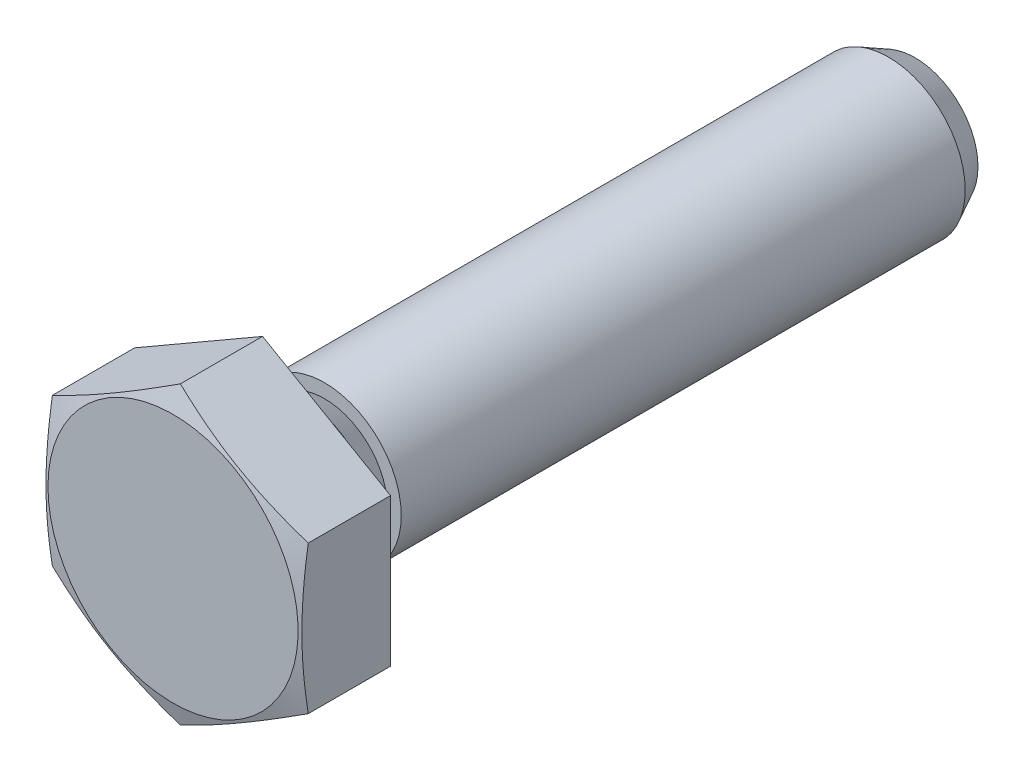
ISO-10303-21;
HEADER;
FILE_DESCRIPTION(('STEP AP214'),'2;1');
FILE_NAME('part.step','',(''),(''),'','','');
FILE_SCHEMA(('AUTOMOTIVE_DESIGN { 1 0 10303 214 1 1 1 1 }'));
ENDSEC;
DATA;
#1=APPLICATION_CONTEXT('core data for automotive mechanical design processes');
#2=APPLICATION_PROTOCOL_DEFINITION('international standard','automotive_design',2000,#1);
#3=PRODUCT_CONTEXT('',#1,'mechanical');
#4=PRODUCT('Part','Part','',(#3));
#5=PRODUCT_RELATED_PRODUCT_CATEGORY('part','',(#4));
#6=PRODUCT_DEFINITION_FORMATION('','',#4);
#7=PRODUCT_DEFINITION_CONTEXT('part definition',#1,'design');
#8=PRODUCT_DEFINITION('design','',#6,#7);
#9=PRODUCT_DEFINITION_SHAPE('','',#8);
#10=(LENGTH_UNIT() NAMED_UNIT(*) SI_UNIT(.MILLI.,.METRE.));
#11=(NAMED_UNIT(*) PLANE_ANGLE_UNIT() SI_UNIT($,.RADIAN.));
#12=(NAMED_UNIT(*) SI_UNIT($,.STERADIAN.) SOLID_ANGLE_UNIT());
#13=UNCERTAINTY_MEASURE_WITH_UNIT(LENGTH_MEASURE(1.E-05),#10,'distance_accuracy_value','');
#14=(GEOMETRIC_REPRESENTATION_CONTEXT(3) GLOBAL_UNCERTAINTY_ASSIGNED_CONTEXT((#13)) GLOBAL_UNIT_ASSIGNED_CONTEXT((#10,
#11,#12)) REPRESENTATION_CONTEXT('',''));
#15=CARTESIAN_POINT('',(0.,0.,0.));
#16=DIRECTION('',(0.,0.,1.));
#17=DIRECTION('',(1.,0.,0.));
#18=AXIS2_PLACEMENT_3D('',#15,#16,#17);
#19=CARTESIAN_POINT('',(0.,0.,0.5));
#20=DIRECTION('',(0.,0.,1.));
#21=DIRECTION('',(1.,0.,0.));
#22=AXIS2_PLACEMENT_3D('',#19,#20,#21);
#23=TOROIDAL_SURFACE('',#22,3.85,0.5);
#24=CARTESIAN_POINT('',(0.,0.,0.5));
#25=DIRECTION('',(0.,0.,1.));
#26=DIRECTION('',(1.,0.,0.));
#27=AXIS2_PLACEMENT_3D('',#24,#25,#26);
#28=CIRCLE('',#27,4.35);
#29=CARTESIAN_POINT('',(4.35,0.,0.5));
#30=VERTEX_POINT('',#29);
#31=EDGE_CURVE('E11',#30,#30,#28,.T.);
#32=ORIENTED_EDGE('',*,*,#31,.F.);
#33=EDGE_LOOP('',(#32));
#34=FACE_BOUND('',#33,.T.);
#35=CARTESIAN_POINT('',(0.,0.,0.));
#36=DIRECTION('',(0.,0.,1.));
#37=DIRECTION('',(1.,0.,0.));
#38=AXIS2_PLACEMENT_3D('',#35,#36,#37);
#39=CIRCLE('',#38,3.85);
#40=CARTESIAN_POINT('',(3.85,0.,0.));
#41=VERTEX_POINT('',#40);
#42=EDGE_CURVE('E23',#41,#41,#39,.T.);
#43=ORIENTED_EDGE('',*,*,#42,.T.);
#44=EDGE_LOOP('',(#43));
#45=FACE_BOUND('',#44,.T.);
#46=ADVANCED_FACE('F16',(#34,#45),#23,.T.);
#47=CARTESIAN_POINT('',(0.,3.85,0.));
#48=DIRECTION('',(0.,0.,-1.));
#49=DIRECTION('',(-1.,0.,0.));
#50=AXIS2_PLACEMENT_3D('',#47,#48,#49);
#51=PLANE('',#50);
#52=CARTESIAN_POINT('',(0.,0.,0.));
#53=DIRECTION('',(0.,0.,1.));
#54=DIRECTION('',(1.,0.,0.));
#55=AXIS2_PLACEMENT_3D('',#52,#53,#54);
#56=CIRCLE('',#55,3.3);
#57=CARTESIAN_POINT('',(3.3,0.,0.));
#58=VERTEX_POINT('',#57);
#59=EDGE_CURVE('E117',#58,#58,#56,.T.);
#60=ORIENTED_EDGE('',*,*,#59,.T.);
#61=EDGE_LOOP('',(#60));
#62=FACE_BOUND('',#61,.T.);
#63=ORIENTED_EDGE('',*,*,#42,.F.);
#64=EDGE_LOOP('',(#63));
#65=FACE_BOUND('',#64,.T.);
#66=ADVANCED_FACE('F123',(#62,#65),#51,.T.);
#67=CARTESIAN_POINT('',(0.,0.,-0.3));
#68=DIRECTION('',(0.,0.,1.));
#69=DIRECTION('',(1.,0.,0.));
#70=AXIS2_PLACEMENT_3D('',#67,#68,#69);
#71=TOROIDAL_SURFACE('',#70,3.3,0.3);
#72=CARTESIAN_POINT('',(0.,0.,-0.3));
#73=DIRECTION('',(0.,0.,1.));
#74=DIRECTION('',(1.,0.,0.));
#75=AXIS2_PLACEMENT_3D('',#72,#73,#74);
#76=CIRCLE('',#75,3.);
#77=CARTESIAN_POINT('',(3.,0.,-0.3));
#78=VERTEX_POINT('',#77);
#79=EDGE_CURVE('E114',#78,#78,#76,.T.);
#80=ORIENTED_EDGE('',*,*,#79,.T.);
#81=EDGE_LOOP('',(#80));
#82=FACE_BOUND('',#81,.T.);
#83=ORIENTED_EDGE('',*,*,#59,.F.);
#84=EDGE_LOOP('',(#83));
#85=FACE_BOUND('',#84,.T.);
#86=ADVANCED_FACE('F125',(#82,#85),#71,.F.);
#87=CARTESIAN_POINT('',(0.,0.,0.5));
#88=DIRECTION('',(0.,0.,1.));
#89=DIRECTION('',(1.,0.,0.));
#90=AXIS2_PLACEMENT_3D('',#87,#88,#89);
#91=CYLINDRICAL_SURFACE('',#90,3.);
#92=CARTESIAN_POINT('',(0.,0.,-0.982527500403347));
#93=DIRECTION('',(0.,0.,1.));
#94=DIRECTION('',(1.,0.,0.));
#95=AXIS2_PLACEMENT_3D('',#92,#93,#94);
#96=CIRCLE('',#95,3.);
#97=CARTESIAN_POINT('',(3.,0.,-0.982527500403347));
#98=VERTEX_POINT('',#97);
#99=EDGE_CURVE('E111',#98,#98,#96,.T.);
#100=ORIENTED_EDGE('',*,*,#99,.T.);
#101=EDGE_LOOP('',(#100));
#102=FACE_BOUND('',#101,.T.);
#103=ORIENTED_EDGE('',*,*,#79,.F.);
#104=EDGE_LOOP('',(#103));
#105=FACE_BOUND('',#104,.T.);
#106=ADVANCED_FACE('F132',(#102,#105),#91,.T.);
#107=CARTESIAN_POINT('',(0.,0.,-0.982527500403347));
#108=DIRECTION('',(0.,0.,1.));
#109=DIRECTION('',(1.,0.,0.));
#110=AXIS2_PLACEMENT_3D('',#107,#108,#109);
#111=CONICAL_SURFACE('',#110,3.,0.523598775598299);
#112=CARTESIAN_POINT('',(0.,0.,-1.92));
#113=DIRECTION('',(0.,0.,1.));
#114=DIRECTION('',(1.,0.,0.));
#115=AXIS2_PLACEMENT_3D('',#112,#113,#114);
#116=CIRCLE('',#115,2.45875);
#117=CARTESIAN_POINT('',(2.45875,0.,-1.92));
#118=VERTEX_POINT('',#117);
#119=EDGE_CURVE('E108',#118,#118,#116,.T.);
#120=ORIENTED_EDGE('',*,*,#119,.T.);
#121=EDGE_LOOP('',(#120));
#122=FACE_BOUND('',#121,.T.);
#123=ORIENTED_EDGE('',*,*,#99,.F.);
#124=EDGE_LOOP('',(#123));
#125=FACE_BOUND('',#124,.T.);
#126=ADVANCED_FACE('F139',(#122,#125),#111,.T.);
#127=CARTESIAN_POINT('',(0.,2.45875,-1.92));
#128=DIRECTION('',(0.,0.,1.));
#129=DIRECTION('',(1.,0.,0.));
#130=AXIS2_PLACEMENT_3D('',#127,#128,#129);
#131=PLANE('',#130);
#132=CARTESIAN_POINT('',(0.,0.,-1.92));
#133=DIRECTION('',(0.,0.,1.));
#134=DIRECTION('',(1.,0.,0.));
#135=AXIS2_PLACEMENT_3D('',#132,#133,#134);
#136=CIRCLE('',#135,3.);
#137=CARTESIAN_POINT('',(3.,0.,-1.92));
#138=VERTEX_POINT('',#137);
#139=EDGE_CURVE('E105',#138,#138,#136,.T.);
#140=ORIENTED_EDGE('',*,*,#139,.T.);
#141=EDGE_LOOP('',(#140));
#142=FACE_BOUND('',#141,.T.);
#143=ORIENTED_EDGE('',*,*,#119,.F.);
#144=EDGE_LOOP('',(#143));
#145=FACE_BOUND('',#144,.T.);
#146=ADVANCED_FACE('F143',(#142,#145),#131,.T.);
#147=CARTESIAN_POINT('',(0.,0.,0.5));
#148=DIRECTION('',(0.,0.,1.));
#149=DIRECTION('',(1.,0.,0.));
#150=AXIS2_PLACEMENT_3D('',#147,#148,#149);
#151=CYLINDRICAL_SURFACE('',#150,3.);
#152=CARTESIAN_POINT('',(0.,0.,-23.95875));
#153=DIRECTION('',(0.,0.,1.));
#154=DIRECTION('',(1.,0.,0.));
#155=AXIS2_PLACEMENT_3D('',#152,#153,#154);
#156=CIRCLE('',#155,3.);
#157=CARTESIAN_POINT('',(3.,0.,-23.95875));
#158=VERTEX_POINT('',#157);
#159=EDGE_CURVE('E102',#158,#158,#156,.T.);
#160=ORIENTED_EDGE('',*,*,#159,.T.);
#161=EDGE_LOOP('',(#160));
#162=FACE_BOUND('',#161,.T.);
#163=ORIENTED_EDGE('',*,*,#139,.F.);
#164=EDGE_LOOP('',(#163));
#165=FACE_BOUND('',#164,.T.);
#166=ADVANCED_FACE('F147',(#162,#165),#151,.T.);
#167=CARTESIAN_POINT('',(0.,0.,-23.95875));
#168=DIRECTION('',(0.,0.,1.));
#169=DIRECTION('',(1.,0.,0.));
#170=AXIS2_PLACEMENT_3D('',#167,#168,#169);
#171=CONICAL_SURFACE('',#170,3.,0.479368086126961);
#172=CARTESIAN_POINT('',(0.,0.,-25.));
#173=DIRECTION('',(0.,0.,1.));
#174=DIRECTION('',(1.,0.,0.));
#175=AXIS2_PLACEMENT_3D('',#172,#173,#174);
#176=CIRCLE('',#175,2.45875);
#177=CARTESIAN_POINT('',(2.45875,0.,-25.));
#178=VERTEX_POINT('',#177);
#179=EDGE_CURVE('E99',#178,#178,#176,.T.);
#180=ORIENTED_EDGE('',*,*,#179,.T.);
#181=EDGE_LOOP('',(#180));
#182=FACE_BOUND('',#181,.T.);
#183=ORIENTED_EDGE('',*,*,#159,.F.);
#184=EDGE_LOOP('',(#183));
#185=FACE_BOUND('',#184,.T.);
#186=ADVANCED_FACE('F151',(#182,#185),#171,.T.);
#187=CARTESIAN_POINT('',(0.,2.45875,-25.));
#188=DIRECTION('',(0.,0.,-1.));
#189=DIRECTION('',(-1.,0.,0.));
#190=AXIS2_PLACEMENT_3D('',#187,#188,#189);
#191=PLANE('',#190);
#192=ORIENTED_EDGE('',*,*,#179,.F.);
#193=EDGE_LOOP('',(#192));
#194=FACE_BOUND('',#193,.T.);
#195=ADVANCED_FACE('F155',(#194),#191,.T.);
#196=CARTESIAN_POINT('',(-5.,-2.8875,0.5));
#197=DIRECTION('',(0.,0.,-1.));
#198=DIRECTION('',(-1.,0.,0.));
#199=AXIS2_PLACEMENT_3D('',#196,#197,#198);
#200=PLANE('',#199);
#201=DIRECTION('',(0.,-1.,0.));
#202=VECTOR('',#201,1.);
#203=CARTESIAN_POINT('',(-5.,2.8875,0.5));
#204=LINE('',#203,#202);
#205=CARTESIAN_POINT('',(-5.,2.8875,0.5));
#206=VERTEX_POINT('',#205);
#207=CARTESIAN_POINT('',(-5.,-2.8875,0.5));
#208=VERTEX_POINT('',#207);
#209=EDGE_CURVE('E82',#206,#208,#204,.T.);
#210=ORIENTED_EDGE('',*,*,#209,.F.);
#211=DIRECTION('',(0.865969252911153,0.500097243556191,0.));
#212=VECTOR('',#211,1.);
#213=CARTESIAN_POINT('',(-5.,2.8875,0.5));
#214=LINE('',#213,#212);
#215=CARTESIAN_POINT('',(0.,5.775,0.5));
#216=VERTEX_POINT('',#215);
#217=EDGE_CURVE('E87',#206,#216,#214,.T.);
#218=ORIENTED_EDGE('',*,*,#217,.T.);
#219=DIRECTION('',(0.865969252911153,-0.500097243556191,0.));
#220=VECTOR('',#219,1.);
#221=CARTESIAN_POINT('',(0.,5.775,0.5));
#222=LINE('',#221,#220);
#223=CARTESIAN_POINT('',(5.,2.8875,0.5));
#224=VERTEX_POINT('',#223);
#225=EDGE_CURVE('E93',#216,#224,#222,.T.);
#226=ORIENTED_EDGE('',*,*,#225,.T.);
#227=DIRECTION('',(0.,-1.,0.));
#228=VECTOR('',#227,1.);
#229=CARTESIAN_POINT('',(5.,2.8875,0.5));
#230=LINE('',#229,#228);
#231=CARTESIAN_POINT('',(5.,-2.8875,0.5));
#232=VERTEX_POINT('',#231);
#233=EDGE_CURVE('E245',#224,#232,#230,.T.);
#234=ORIENTED_EDGE('',*,*,#233,.T.);
#235=DIRECTION('',(-0.865969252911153,-0.500097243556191,0.));
#236=VECTOR('',#235,1.);
#237=CARTESIAN_POINT('',(5.,-2.8875,0.5));
#238=LINE('',#237,#236);
#239=CARTESIAN_POINT('',(0.,-5.775,0.5));
#240=VERTEX_POINT('',#239);
#241=EDGE_CURVE('E231',#232,#240,#238,.T.);
#242=ORIENTED_EDGE('',*,*,#241,.T.);
#243=DIRECTION('',(-0.865969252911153,0.500097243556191,0.));
#244=VECTOR('',#243,1.);
#245=CARTESIAN_POINT('',(0.,-5.775,0.5));
#246=LINE('',#245,#244);
#247=EDGE_CURVE('E229',#240,#208,#246,.T.);
#248=ORIENTED_EDGE('',*,*,#247,.T.);
#249=EDGE_LOOP('',(#210,#218,#226,#234,#242,#248));
#250=FACE_BOUND('',#249,.T.);
#251=ORIENTED_EDGE('',*,*,#31,.T.);
#252=EDGE_LOOP('',(#251));
#253=FACE_BOUND('',#252,.T.);
#254=ADVANCED_FACE('F159',(#250,#253),#200,.T.);
#255=CARTESIAN_POINT('',(-5.,2.8875,0.5));
#256=DIRECTION('',(-1.,0.,0.));
#257=DIRECTION('',(0.,0.,1.));
#258=AXIS2_PLACEMENT_3D('',#255,#256,#257);
#259=PLANE('',#258);
#260=CARTESIAN_POINT('',(-5.,-7.63946219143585,2.6270341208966));
#261=CARTESIAN_POINT('',(-5.,-7.41281266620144,2.68839123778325));
#262=CARTESIAN_POINT('',(-5.,-7.18596133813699,2.74901642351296));
#263=CARTESIAN_POINT('',(-5.,-6.73175411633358,2.86840192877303));
#264=CARTESIAN_POINT('',(-5.,-6.50439819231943,2.92716213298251));
#265=CARTESIAN_POINT('',(-5.,-6.04878200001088,3.04249171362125));
#266=CARTESIAN_POINT('',(-5.,-5.82052090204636,3.09905782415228));
#267=CARTESIAN_POINT('',(-5.,-5.36331657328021,3.20936096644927));
#268=CARTESIAN_POINT('',(-5.,-5.13437335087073,3.26309803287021));
#269=CARTESIAN_POINT('',(-5.,-4.67835713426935,3.36644809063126));
#270=CARTESIAN_POINT('',(-5.,-4.45129342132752,3.41610183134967));
#271=CARTESIAN_POINT('',(-5.,-3.99627399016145,3.51113059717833));
#272=CARTESIAN_POINT('',(-5.,-3.76831830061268,3.55650575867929));
#273=CARTESIAN_POINT('',(-5.,-3.31144655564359,3.64194061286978));
#274=CARTESIAN_POINT('',(-5.,-3.0825306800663,3.68200125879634));
#275=CARTESIAN_POINT('',(-5.,-2.62364102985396,3.75560301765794));
#276=CARTESIAN_POINT('',(-5.,-2.39366725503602,3.78914412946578));
#277=CARTESIAN_POINT('',(-5.,-1.93195203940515,3.84847369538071));
#278=CARTESIAN_POINT('',(-5.,-1.70020728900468,3.87423677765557));
#279=CARTESIAN_POINT('',(-5.,-1.23587231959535,3.91656765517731));
#280=CARTESIAN_POINT('',(-5.,-1.00328213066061,3.93313577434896));
#281=CARTESIAN_POINT('',(-5.,-0.537748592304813,3.95607720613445));
#282=CARTESIAN_POINT('',(-5.,-0.304805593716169,3.96245749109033));
#283=CARTESIAN_POINT('',(-5.,0.161130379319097,3.96462349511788));
#284=CARTESIAN_POINT('',(-5.,0.394123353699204,3.9604092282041));
#285=CARTESIAN_POINT('',(-5.,0.860893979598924,3.94161836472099));
#286=CARTESIAN_POINT('',(-5.,1.09466942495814,3.92698808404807));
#287=CARTESIAN_POINT('',(-5.,1.56142284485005,3.88821444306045));
#288=CARTESIAN_POINT('',(-5.,1.79440079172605,3.86407075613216));
#289=CARTESIAN_POINT('',(-5.,2.25956828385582,3.80751771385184));
#290=CARTESIAN_POINT('',(-5.,2.49175682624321,3.77510023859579));
#291=CARTESIAN_POINT('',(-5.,2.95505625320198,3.70338237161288));
#292=CARTESIAN_POINT('',(-5.,3.18616713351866,3.66408195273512));
#293=CARTESIAN_POINT('',(-5.,3.63306122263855,3.58248240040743));
#294=CARTESIAN_POINT('',(-5.,3.84890657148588,3.54052013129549));
#295=CARTESIAN_POINT('',(-5.,4.27977835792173,3.45256422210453));
#296=CARTESIAN_POINT('',(-5.,4.49480476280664,3.40657042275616));
#297=CARTESIAN_POINT('',(-5.,4.92415472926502,3.31130044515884));
#298=CARTESIAN_POINT('',(-5.,5.1384781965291,3.26202384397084));
#299=CARTESIAN_POINT('',(-5.,5.56649441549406,3.16079723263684));
#300=CARTESIAN_POINT('',(-5.,5.78018715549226,3.10884717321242));
#301=CARTESIAN_POINT('',(-5.,6.42057759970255,2.94971540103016));
#302=CARTESIAN_POINT('',(-5.,6.84646584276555,2.8392797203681));
#303=CARTESIAN_POINT('',(-5.,7.69662619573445,2.61255430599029));
#304=CARTESIAN_POINT('',(-5.,8.12089843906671,2.49626506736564));
#305=CARTESIAN_POINT('',(-5.,8.96241707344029,2.26120860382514));
#306=CARTESIAN_POINT('',(-5.,9.37967934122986,2.14249806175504));
#307=CARTESIAN_POINT('',(-5.,10.2133768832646,1.90217595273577));
#308=CARTESIAN_POINT('',(-5.,10.6298121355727,1.7805643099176));
#309=CARTESIAN_POINT('',(-5.,11.4613370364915,1.53540730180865));
#310=CARTESIAN_POINT('',(-5.,11.876427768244,1.41186560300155));
#311=CARTESIAN_POINT('',(-5.,12.70609470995,1.16313510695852));
#312=CARTESIAN_POINT('',(-5.,13.120670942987,1.03794638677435));
#313=CARTESIAN_POINT('',(-5.,13.5350675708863,0.912173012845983));
#314=B_SPLINE_CURVE_WITH_KNOTS('',3,(#260,#261,#262,#263,#264,#265,#266,#267,#268,#269,#270,
#271,#272,#273,#274,#275,#276,#277,#278,#279,#280,#281,#282,#283,#284,#285,#286,#287,#288,#289,
#290,#291,#292,#293,#294,#295,#296,#297,#298,#299,#300,#301,#302,#303,#304,#305,#306,#307,#308,
#309,#310,#311,#312,#313),.UNSPECIFIED.,.F.,.F.,(4,2,2,2,2,2,2,2,2,2,2,2,2,2,2,2,2,2,2,2,2,2,2,
2,2,2,4),(0.,0.704427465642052,1.40889840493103,2.11438057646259,2.81985410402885,
3.51710954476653,4.21434275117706,4.91145072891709,5.60855882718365,6.30791690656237,
7.00725034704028,7.70610497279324,8.40495867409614,9.10744058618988,9.80994661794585,
10.5131447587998,11.2163456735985,11.87595945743,12.5355993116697,13.1953243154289,
13.8550614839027,15.1749100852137,16.4946472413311,17.7960931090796,19.0975730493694,
20.3968251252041,21.6960166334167),.UNSPECIFIED.);
#315=CARTESIAN_POINT('',(-5.,2.8875,3.71325728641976));
#316=VERTEX_POINT('',#315);
#317=CARTESIAN_POINT('',(-5.,-2.8875,3.71325728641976));
#318=VERTEX_POINT('',#317);
#319=EDGE_CURVE('E71',#316,#318,#314,.F.);
#320=ORIENTED_EDGE('',*,*,#319,.F.);
#321=DIRECTION('',(0.,0.,1.));
#322=VECTOR('',#321,1.);
#323=CARTESIAN_POINT('',(-5.,2.8875,0.5));
#324=LINE('',#323,#322);
#325=EDGE_CURVE('E80',#206,#316,#324,.T.);
#326=ORIENTED_EDGE('',*,*,#325,.F.);
#327=ORIENTED_EDGE('',*,*,#209,.T.);
#328=DIRECTION('',(0.,0.,1.));
#329=VECTOR('',#328,1.);
#330=CARTESIAN_POINT('',(-5.,-2.8875,0.5));
#331=LINE('',#330,#329);
#332=EDGE_CURVE('E38',#208,#318,#331,.T.);
#333=ORIENTED_EDGE('',*,*,#332,.T.);
#334=EDGE_LOOP('',(#320,#326,#327,#333));
#335=FACE_BOUND('',#334,.T.);
#336=ADVANCED_FACE('F78',(#335),#259,.T.);
#337=CARTESIAN_POINT('',(0.,-5.775,0.5));
#338=DIRECTION('',(0.500097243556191,0.865969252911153,0.));
#339=DIRECTION('',(0.865969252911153,-0.500097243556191,0.));
#340=AXIS2_PLACEMENT_3D('',#337,#338,#339);
#341=PLANE('',#340);
#342=DIRECTION('',(0.,0.,1.));
#343=VECTOR('',#342,1.);
#344=CARTESIAN_POINT('',(0.,-5.775,0.5));
#345=LINE('',#344,#343);
#346=CARTESIAN_POINT('',(0.,-5.775,3.71289386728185));
#347=VERTEX_POINT('',#346);
#348=EDGE_CURVE('E236',#240,#347,#345,.T.);
#349=ORIENTED_EDGE('',*,*,#348,.T.);
#350=CARTESIAN_POINT('',(2.00000000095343E-07,-5.7750001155,3.71289382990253));
#351=CARTESIAN_POINT('',(-0.207321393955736,-5.65527189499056,3.75165513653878));
#352=CARTESIAN_POINT('',(-0.415186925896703,-5.53522955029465,3.7868847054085));
#353=CARTESIAN_POINT('',(-0.831987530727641,-5.29452720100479,3.84883123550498));
#354=CARTESIAN_POINT('',(-1.0409231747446,-5.17386686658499,3.87554303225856));
#355=CARTESIAN_POINT('',(-1.45802479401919,-4.93299068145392,3.91879166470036));
#356=CARTESIAN_POINT('',(-1.66618479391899,-4.81277828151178,3.93540329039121));
#357=CARTESIAN_POINT('',(-2.08289124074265,-4.57213030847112,3.95769335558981));
#358=CARTESIAN_POINT('',(-2.2914375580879,-4.45169481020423,3.96337496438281));
#359=CARTESIAN_POINT('',(-2.70853145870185,-4.21082308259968,3.96341052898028));
#360=CARTESIAN_POINT('',(-2.9170790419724,-4.09038685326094,3.95776445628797));
#361=CARTESIAN_POINT('',(-3.33378927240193,-3.84973669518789,3.93554297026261));
#362=CARTESIAN_POINT('',(-3.54195179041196,-3.72952284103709,3.91896438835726));
#363=CARTESIAN_POINT('',(-3.95905919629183,-3.48864331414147,3.87577788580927));
#364=CARTESIAN_POINT('',(-4.16799811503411,-3.3679810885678,3.84909514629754));
#365=CARTESIAN_POINT('',(-4.58480571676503,-3.12727469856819,3.78720201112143));
#366=CARTESIAN_POINT('',(-4.79267497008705,-3.00723020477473,3.75199677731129));
#367=CARTESIAN_POINT('',(-5.0000002,-2.8874998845,3.71325724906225));
#368=B_SPLINE_CURVE_WITH_KNOTS('',3,(#350,#351,#352,#353,#354,#355,#356,#357,#358,#359,#360,
#361,#362,#363,#364,#365,#366,#367),.UNSPECIFIED.,.F.,.F.,(4,2,2,2,2,2,2,2,4),(0.,
0.727639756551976,1.45571985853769,2.17834082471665,2.90075222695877,3.62316544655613,
4.34578813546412,5.07386975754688,5.80151149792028),.UNSPECIFIED.);
#369=EDGE_CURVE('E83',#347,#318,#368,.T.);
#370=ORIENTED_EDGE('',*,*,#369,.T.);
#371=ORIENTED_EDGE('',*,*,#332,.F.);
#372=ORIENTED_EDGE('',*,*,#247,.F.);
#373=EDGE_LOOP('',(#349,#370,#371,#372));
#374=FACE_BOUND('',#373,.T.);
#375=ADVANCED_FACE('F164',(#374),#341,.F.);
#376=CARTESIAN_POINT('',(5.,-2.8875,0.5));
#377=DIRECTION('',(-0.500097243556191,0.865969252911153,0.));
#378=DIRECTION('',(0.865969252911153,0.500097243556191,0.));
#379=AXIS2_PLACEMENT_3D('',#376,#377,#378);
#380=PLANE('',#379);
#381=DIRECTION('',(0.,0.,1.));
#382=VECTOR('',#381,1.);
#383=CARTESIAN_POINT('',(5.,-2.8875,0.5));
#384=LINE('',#383,#382);
#385=CARTESIAN_POINT('',(5.,-2.8875,3.71325728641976));
#386=VERTEX_POINT('',#385);
#387=EDGE_CURVE('E239',#232,#386,#384,.T.);
#388=ORIENTED_EDGE('',*,*,#387,.T.);
#389=CARTESIAN_POINT('',(5.0000002,-2.8874998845,3.71325724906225));
#390=CARTESIAN_POINT('',(4.79267497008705,-3.00723020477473,3.75199677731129));
#391=CARTESIAN_POINT('',(4.58480571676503,-3.12727469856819,3.78720201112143));
#392=CARTESIAN_POINT('',(4.16799811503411,-3.3679810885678,3.84909514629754));
#393=CARTESIAN_POINT('',(3.95905919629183,-3.48864331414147,3.87577788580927));
#394=CARTESIAN_POINT('',(3.54195179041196,-3.72952284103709,3.91896438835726));
#395=CARTESIAN_POINT('',(3.33378927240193,-3.84973669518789,3.93554297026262));
#396=CARTESIAN_POINT('',(2.9170790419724,-4.09038685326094,3.95776445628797));
#397=CARTESIAN_POINT('',(2.70853145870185,-4.21082308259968,3.96341052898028));
#398=CARTESIAN_POINT('',(2.29143755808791,-4.45169481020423,3.96337496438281));
#399=CARTESIAN_POINT('',(2.08289124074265,-4.57213030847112,3.95769335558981));
#400=CARTESIAN_POINT('',(1.66618479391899,-4.81277828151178,3.93540329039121));
#401=CARTESIAN_POINT('',(1.45802479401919,-4.93299068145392,3.91879166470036));
#402=CARTESIAN_POINT('',(1.04092317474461,-5.17386686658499,3.87554303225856));
#403=CARTESIAN_POINT('',(0.831987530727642,-5.29452720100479,3.84883123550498));
#404=CARTESIAN_POINT('',(0.415186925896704,-5.53522955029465,3.7868847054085));
#405=CARTESIAN_POINT('',(0.207321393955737,-5.65527189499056,3.75165513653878));
#406=CARTESIAN_POINT('',(-1.99999999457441E-07,-5.7750001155,3.71289382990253));
#407=B_SPLINE_CURVE_WITH_KNOTS('',3,(#389,#390,#391,#392,#393,#394,#395,#396,#397,#398,#399,
#400,#401,#402,#403,#404,#405,#406),.UNSPECIFIED.,.F.,.F.,(4,2,2,2,2,2,2,2,4),(0.,
0.727641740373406,1.45572336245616,2.17834605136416,2.90075927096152,3.62317067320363,
4.3457916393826,5.07387174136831,5.80151149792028),.UNSPECIFIED.);
#408=EDGE_CURVE('E202',#386,#347,#407,.T.);
#409=ORIENTED_EDGE('',*,*,#408,.T.);
#410=ORIENTED_EDGE('',*,*,#348,.F.);
#411=ORIENTED_EDGE('',*,*,#241,.F.);
#412=EDGE_LOOP('',(#388,#409,#410,#411));
#413=FACE_BOUND('',#412,.T.);
#414=ADVANCED_FACE('F207',(#413),#380,.F.);
#415=CARTESIAN_POINT('',(5.,2.8875,0.5));
#416=DIRECTION('',(-1.,0.,0.));
#417=DIRECTION('',(0.,0.,1.));
#418=AXIS2_PLACEMENT_3D('',#415,#416,#417);
#419=PLANE('',#418);
#420=DIRECTION('',(0.,0.,1.));
#421=VECTOR('',#420,1.);
#422=CARTESIAN_POINT('',(5.,2.8875,0.5));
#423=LINE('',#422,#421);
#424=CARTESIAN_POINT('',(5.,2.8875,3.71325728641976));
#425=VERTEX_POINT('',#424);
#426=EDGE_CURVE('E91',#224,#425,#423,.T.);
#427=ORIENTED_EDGE('',*,*,#426,.T.);
#428=CARTESIAN_POINT('',(5.,-7.63946219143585,2.6270341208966));
#429=CARTESIAN_POINT('',(5.,-7.41281266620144,2.68839123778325));
#430=CARTESIAN_POINT('',(5.,-7.18596133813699,2.74901642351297));
#431=CARTESIAN_POINT('',(5.,-6.73175411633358,2.86840192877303));
#432=CARTESIAN_POINT('',(5.,-6.50439819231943,2.92716213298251));
#433=CARTESIAN_POINT('',(5.,-6.04878200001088,3.04249171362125));
#434=CARTESIAN_POINT('',(5.,-5.82052090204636,3.09905782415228));
#435=CARTESIAN_POINT('',(5.,-5.36331657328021,3.20936096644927));
#436=CARTESIAN_POINT('',(5.,-5.13437335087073,3.26309803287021));
#437=CARTESIAN_POINT('',(5.,-4.67835713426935,3.36644809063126));
#438=CARTESIAN_POINT('',(5.,-4.45129342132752,3.41610183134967));
#439=CARTESIAN_POINT('',(5.,-3.99627399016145,3.51113059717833));
#440=CARTESIAN_POINT('',(5.,-3.76831830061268,3.55650575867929));
#441=CARTESIAN_POINT('',(5.,-3.31144655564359,3.64194061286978));
#442=CARTESIAN_POINT('',(5.,-3.0825306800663,3.68200125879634));
#443=CARTESIAN_POINT('',(5.,-2.62364102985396,3.75560301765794));
#444=CARTESIAN_POINT('',(5.,-2.39366725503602,3.78914412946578));
#445=CARTESIAN_POINT('',(5.,-1.93195203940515,3.84847369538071));
#446=CARTESIAN_POINT('',(5.,-1.70020728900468,3.87423677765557));
#447=CARTESIAN_POINT('',(5.,-1.23587231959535,3.91656765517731));
#448=CARTESIAN_POINT('',(5.,-1.00328213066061,3.93313577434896));
#449=CARTESIAN_POINT('',(5.,-0.537748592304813,3.95607720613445));
#450=CARTESIAN_POINT('',(5.,-0.304805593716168,3.96245749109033));
#451=CARTESIAN_POINT('',(5.,0.161130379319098,3.96462349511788));
#452=CARTESIAN_POINT('',(5.,0.394123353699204,3.9604092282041));
#453=CARTESIAN_POINT('',(5.,0.860893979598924,3.94161836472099));
#454=CARTESIAN_POINT('',(5.,1.09466942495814,3.92698808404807));
#455=CARTESIAN_POINT('',(5.,1.56142284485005,3.88821444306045));
#456=CARTESIAN_POINT('',(5.,1.79440079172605,3.86407075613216));
#457=CARTESIAN_POINT('',(5.,2.25956828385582,3.80751771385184));
#458=CARTESIAN_POINT('',(5.,2.49175682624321,3.77510023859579));
#459=CARTESIAN_POINT('',(5.,2.95505625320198,3.70338237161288));
#460=CARTESIAN_POINT('',(5.,3.18616713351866,3.66408195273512));
#461=CARTESIAN_POINT('',(5.,3.63306122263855,3.58248240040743));
#462=CARTESIAN_POINT('',(5.,3.84890657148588,3.54052013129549));
#463=CARTESIAN_POINT('',(5.,4.27977835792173,3.45256422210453));
#464=CARTESIAN_POINT('',(5.,4.49480476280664,3.40657042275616));
#465=CARTESIAN_POINT('',(5.,4.92415472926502,3.31130044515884));
#466=CARTESIAN_POINT('',(5.,5.1384781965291,3.26202384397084));
#467=CARTESIAN_POINT('',(5.,5.56649441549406,3.16079723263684));
#468=CARTESIAN_POINT('',(5.,5.78018715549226,3.10884717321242));
#469=CARTESIAN_POINT('',(5.,6.42057759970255,2.94971540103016));
#470=CARTESIAN_POINT('',(5.,6.84646584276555,2.8392797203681));
#471=CARTESIAN_POINT('',(5.,7.69662619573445,2.61255430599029));
#472=CARTESIAN_POINT('',(5.,8.12089843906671,2.49626506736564));
#473=CARTESIAN_POINT('',(5.,8.96241707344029,2.26120860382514));
#474=CARTESIAN_POINT('',(5.,9.37967934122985,2.14249806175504));
#475=CARTESIAN_POINT('',(5.,10.2133768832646,1.90217595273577));
#476=CARTESIAN_POINT('',(5.,10.6298121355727,1.7805643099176));
#477=CARTESIAN_POINT('',(5.,11.4613370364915,1.53540730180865));
#478=CARTESIAN_POINT('',(5.,11.876427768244,1.41186560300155));
#479=CARTESIAN_POINT('',(5.,12.70609470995,1.16313510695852));
#480=CARTESIAN_POINT('',(5.,13.120670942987,1.03794638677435));
#481=CARTESIAN_POINT('',(5.,13.5350675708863,0.912173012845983));
#482=B_SPLINE_CURVE_WITH_KNOTS('',3,(#428,#429,#430,#431,#432,#433,#434,#435,#436,#437,#438,
#439,#440,#441,#442,#443,#444,#445,#446,#447,#448,#449,#450,#451,#452,#453,#454,#455,#456,#457,
#458,#459,#460,#461,#462,#463,#464,#465,#466,#467,#468,#469,#470,#471,#472,#473,#474,#475,#476,
#477,#478,#479,#480,#481),.UNSPECIFIED.,.F.,.F.,(4,2,2,2,2,2,2,2,2,2,2,2,2,2,2,2,2,2,2,2,2,2,2,
2,2,2,4),(0.,0.704427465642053,1.40889840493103,2.11438057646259,2.81985410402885,
3.51710954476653,4.21434275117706,4.91145072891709,5.60855882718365,6.30791690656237,
7.00725034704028,7.70610497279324,8.40495867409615,9.10744058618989,9.80994661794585,
10.5131447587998,11.2163456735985,11.87595945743,12.5355993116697,13.1953243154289,
13.8550614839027,15.1749100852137,16.4946472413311,17.7960931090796,19.0975730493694,
20.3968251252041,21.6960166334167),.UNSPECIFIED.);
#483=EDGE_CURVE('E197',#425,#386,#482,.F.);
#484=ORIENTED_EDGE('',*,*,#483,.T.);
#485=ORIENTED_EDGE('',*,*,#387,.F.);
#486=ORIENTED_EDGE('',*,*,#233,.F.);
#487=EDGE_LOOP('',(#427,#484,#485,#486));
#488=FACE_BOUND('',#487,.T.);
#489=ADVANCED_FACE('F210',(#488),#419,.F.);
#490=CARTESIAN_POINT('',(0.,5.775,0.5));
#491=DIRECTION('',(-0.500097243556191,-0.865969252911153,0.));
#492=DIRECTION('',(-0.865969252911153,0.500097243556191,0.));
#493=AXIS2_PLACEMENT_3D('',#490,#491,#492);
#494=PLANE('',#493);
#495=DIRECTION('',(0.,0.,1.));
#496=VECTOR('',#495,1.);
#497=CARTESIAN_POINT('',(0.,5.775,0.5));
#498=LINE('',#497,#496);
#499=CARTESIAN_POINT('',(0.,5.775,3.71289386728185));
#500=VERTEX_POINT('',#499);
#501=EDGE_CURVE('E89',#216,#500,#498,.T.);
#502=ORIENTED_EDGE('',*,*,#501,.T.);
#503=CARTESIAN_POINT('',(-1.99999999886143E-07,5.7750001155,3.71289382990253));
#504=CARTESIAN_POINT('',(0.207321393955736,5.65527189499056,3.75165513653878));
#505=CARTESIAN_POINT('',(0.415186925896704,5.53522955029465,3.7868847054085));
#506=CARTESIAN_POINT('',(0.831987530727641,5.29452720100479,3.84883123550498));
#507=CARTESIAN_POINT('',(1.0409231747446,5.17386686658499,3.87554303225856));
#508=CARTESIAN_POINT('',(1.45802479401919,4.93299068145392,3.91879166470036));
#509=CARTESIAN_POINT('',(1.66618479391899,4.81277828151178,3.93540329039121));
#510=CARTESIAN_POINT('',(2.08289124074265,4.57213030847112,3.95769335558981));
#511=CARTESIAN_POINT('',(2.2914375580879,4.45169481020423,3.96337496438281));
#512=CARTESIAN_POINT('',(2.70853145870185,4.21082308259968,3.96341052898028));
#513=CARTESIAN_POINT('',(2.9170790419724,4.09038685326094,3.95776445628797));
#514=CARTESIAN_POINT('',(3.33378927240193,3.84973669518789,3.93554297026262));
#515=CARTESIAN_POINT('',(3.54195179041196,3.7295228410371,3.91896438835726));
#516=CARTESIAN_POINT('',(3.95905919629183,3.48864331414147,3.87577788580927));
#517=CARTESIAN_POINT('',(4.16799811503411,3.3679810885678,3.84909514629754));
#518=CARTESIAN_POINT('',(4.58480571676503,3.12727469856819,3.78720201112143));
#519=CARTESIAN_POINT('',(4.79267497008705,3.00723020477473,3.75199677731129));
#520=CARTESIAN_POINT('',(5.0000002,2.8874998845,3.71325724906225));
#521=B_SPLINE_CURVE_WITH_KNOTS('',3,(#503,#504,#505,#506,#507,#508,#509,#510,#511,#512,#513,
#514,#515,#516,#517,#518,#519,#520),.UNSPECIFIED.,.F.,.F.,(4,2,2,2,2,2,2,2,4),(0.,
0.727639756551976,1.45571985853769,2.17834082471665,2.90075222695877,3.62316544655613,
4.34578813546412,5.07386975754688,5.80151149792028),.UNSPECIFIED.);
#522=EDGE_CURVE('E30',#500,#425,#521,.T.);
#523=ORIENTED_EDGE('',*,*,#522,.T.);
#524=ORIENTED_EDGE('',*,*,#426,.F.);
#525=ORIENTED_EDGE('',*,*,#225,.F.);
#526=EDGE_LOOP('',(#502,#523,#524,#525));
#527=FACE_BOUND('',#526,.T.);
#528=ADVANCED_FACE('F214',(#527),#494,.F.);
#529=CARTESIAN_POINT('',(-5.,2.8875,0.5));
#530=DIRECTION('',(0.500097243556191,-0.865969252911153,0.));
#531=DIRECTION('',(-0.865969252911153,-0.500097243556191,0.));
#532=AXIS2_PLACEMENT_3D('',#529,#530,#531);
#533=PLANE('',#532);
#534=ORIENTED_EDGE('',*,*,#325,.T.);
#535=CARTESIAN_POINT('',(-5.0000002,2.8874998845,3.71325724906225));
#536=CARTESIAN_POINT('',(-4.79267497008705,3.00723020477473,3.75199677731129));
#537=CARTESIAN_POINT('',(-4.58480571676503,3.12727469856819,3.78720201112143));
#538=CARTESIAN_POINT('',(-4.16799811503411,3.3679810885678,3.84909514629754));
#539=CARTESIAN_POINT('',(-3.95905919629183,3.48864331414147,3.87577788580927));
#540=CARTESIAN_POINT('',(-3.54195179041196,3.7295228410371,3.91896438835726));
#541=CARTESIAN_POINT('',(-3.33378927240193,3.84973669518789,3.93554297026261));
#542=CARTESIAN_POINT('',(-2.9170790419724,4.09038685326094,3.95776445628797));
#543=CARTESIAN_POINT('',(-2.70853145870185,4.21082308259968,3.96341052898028));
#544=CARTESIAN_POINT('',(-2.2914375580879,4.45169481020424,3.96337496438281));
#545=CARTESIAN_POINT('',(-2.08289124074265,4.57213030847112,3.95769335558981));
#546=CARTESIAN_POINT('',(-1.66618479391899,4.81277828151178,3.93540329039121));
#547=CARTESIAN_POINT('',(-1.45802479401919,4.93299068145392,3.91879166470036));
#548=CARTESIAN_POINT('',(-1.0409231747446,5.17386686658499,3.87554303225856));
#549=CARTESIAN_POINT('',(-0.831987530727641,5.29452720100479,3.84883123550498));
#550=CARTESIAN_POINT('',(-0.415186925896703,5.53522955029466,3.7868847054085));
#551=CARTESIAN_POINT('',(-0.207321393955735,5.65527189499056,3.75165513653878));
#552=CARTESIAN_POINT('',(2.0000000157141E-07,5.7750001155,3.71289382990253));
#553=B_SPLINE_CURVE_WITH_KNOTS('',3,(#535,#536,#537,#538,#539,#540,#541,#542,#543,#544,#545,
#546,#547,#548,#549,#550,#551,#552),.UNSPECIFIED.,.F.,.F.,(4,2,2,2,2,2,2,2,4),(0.,
0.727641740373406,1.45572336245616,2.17834605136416,2.90075927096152,3.62317067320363,
4.3457916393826,5.07387174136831,5.80151149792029),.UNSPECIFIED.);
#554=EDGE_CURVE('E67',#316,#500,#553,.T.);
#555=ORIENTED_EDGE('',*,*,#554,.T.);
#556=ORIENTED_EDGE('',*,*,#501,.F.);
#557=ORIENTED_EDGE('',*,*,#217,.F.);
#558=EDGE_LOOP('',(#534,#555,#556,#557));
#559=FACE_BOUND('',#558,.T.);
#560=ADVANCED_FACE('F85',(#559),#533,.F.);
#561=CARTESIAN_POINT('',(0.,0.,3.67551454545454));
#562=DIRECTION('',(0.,0.,-1.));
#563=DIRECTION('',(-1.,0.,0.));
#564=AXIS2_PLACEMENT_3D('',#561,#562,#563);
#565=CONICAL_SURFACE('',#564,5.8905,1.25780359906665);
#566=ORIENTED_EDGE('',*,*,#319,.T.);
#567=ORIENTED_EDGE('',*,*,#369,.F.);
#568=ORIENTED_EDGE('',*,*,#408,.F.);
#569=ORIENTED_EDGE('',*,*,#483,.F.);
#570=ORIENTED_EDGE('',*,*,#522,.F.);
#571=ORIENTED_EDGE('',*,*,#554,.F.);
#572=EDGE_LOOP('',(#566,#567,#568,#569,#570,#571));
#573=FACE_BOUND('',#572,.T.);
#574=CARTESIAN_POINT('',(0.,0.,4.));
#575=DIRECTION('',(0.,0.,-1.));
#576=DIRECTION('',(-1.,0.,0.));
#577=AXIS2_PLACEMENT_3D('',#574,#575,#576);
#578=CIRCLE('',#577,4.88785821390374);
#579=CARTESIAN_POINT('',(-4.88785821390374,0.,4.));
#580=VERTEX_POINT('',#579);
#581=EDGE_CURVE('E75',#580,#580,#578,.F.);
#582=ORIENTED_EDGE('',*,*,#581,.F.);
#583=EDGE_LOOP('',(#582));
#584=FACE_BOUND('',#583,.T.);
#585=ADVANCED_FACE('F69',(#573,#584),#565,.T.);
#586=CARTESIAN_POINT('',(-5.,-2.8875,4.));
#587=DIRECTION('',(0.,0.,-1.));
#588=DIRECTION('',(-1.,0.,0.));
#589=AXIS2_PLACEMENT_3D('',#586,#587,#588);
#590=PLANE('',#589);
#591=ORIENTED_EDGE('',*,*,#581,.T.);
#592=EDGE_LOOP('',(#591));
#593=FACE_BOUND('',#592,.T.);
#594=ADVANCED_FACE('F180',(#593),#590,.F.);
#595=CLOSED_SHELL('',(#46,#66,#86,#106,#126,#146,#166,#186,#195,#254,#336,#375,#414,#489,#528,
#560,#585,#594));
#596=MANIFOLD_SOLID_BREP('B1',#595);
#597=ADVANCED_BREP_SHAPE_REPRESENTATION('',(#18,#596),#14);
#598=SHAPE_DEFINITION_REPRESENTATION(#9,#597);
ENDSEC;
END-ISO-10303-21;
